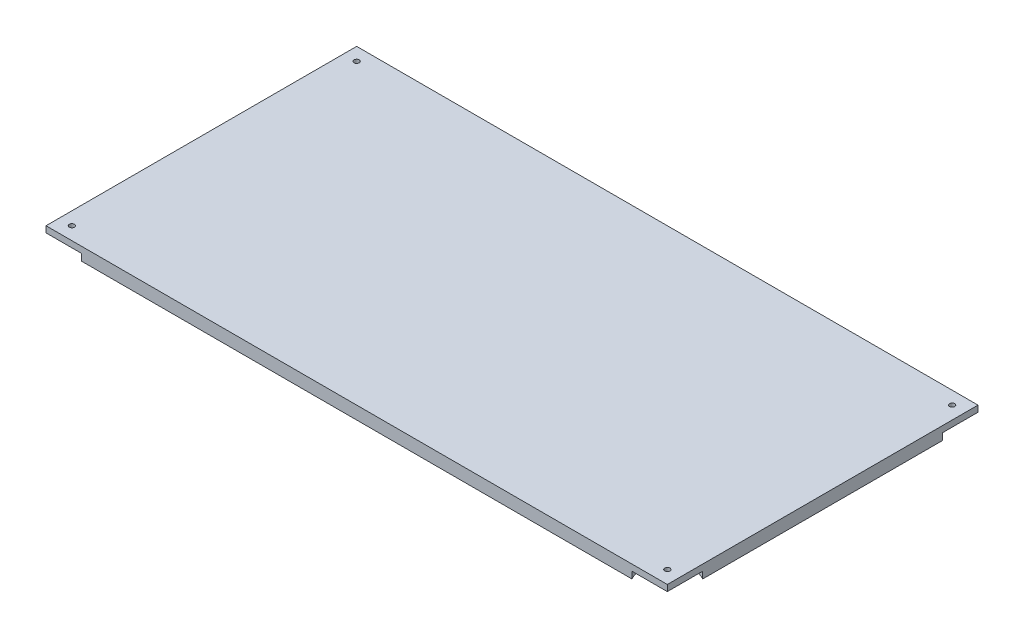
ISO-10303-21;
HEADER;
FILE_DESCRIPTION(('STEP AP214'),'2;1');
FILE_NAME('part.step','',(''),(''),'','','');
FILE_SCHEMA(('AUTOMOTIVE_DESIGN { 1 0 10303 214 1 1 1 1 }'));
ENDSEC;
DATA;
#1=APPLICATION_CONTEXT('core data for automotive mechanical design processes');
#2=APPLICATION_PROTOCOL_DEFINITION('international standard','automotive_design',2000,#1);
#3=PRODUCT_CONTEXT('',#1,'mechanical');
#4=PRODUCT('Part','Part','',(#3));
#5=PRODUCT_RELATED_PRODUCT_CATEGORY('part','',(#4));
#6=PRODUCT_DEFINITION_FORMATION('','',#4);
#7=PRODUCT_DEFINITION_CONTEXT('part definition',#1,'design');
#8=PRODUCT_DEFINITION('design','',#6,#7);
#9=PRODUCT_DEFINITION_SHAPE('','',#8);
#10=(LENGTH_UNIT() NAMED_UNIT(*) SI_UNIT(.MILLI.,.METRE.));
#11=(NAMED_UNIT(*) PLANE_ANGLE_UNIT() SI_UNIT($,.RADIAN.));
#12=(NAMED_UNIT(*) SI_UNIT($,.STERADIAN.) SOLID_ANGLE_UNIT());
#13=UNCERTAINTY_MEASURE_WITH_UNIT(LENGTH_MEASURE(1.E-05),#10,'distance_accuracy_value','');
#14=(GEOMETRIC_REPRESENTATION_CONTEXT(3) GLOBAL_UNCERTAINTY_ASSIGNED_CONTEXT((#13)) GLOBAL_UNIT_ASSIGNED_CONTEXT((#10,
#11,#12)) REPRESENTATION_CONTEXT('',''));
#15=CARTESIAN_POINT('',(0.,0.,0.));
#16=DIRECTION('',(0.,0.,1.));
#17=DIRECTION('',(1.,0.,0.));
#18=AXIS2_PLACEMENT_3D('',#15,#16,#17);
#19=CARTESIAN_POINT('',(-48.4646519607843,0.,115.611650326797));
#20=DIRECTION('',(0.,1.,0.));
#21=DIRECTION('',(0.,0.,1.));
#22=AXIS2_PLACEMENT_3D('',#19,#20,#21);
#23=PLANE('',#22);
#24=CARTESIAN_POINT('',(249.985348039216,0.,-30.4383496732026));
#25=DIRECTION('',(0.,-1.,0.));
#26=DIRECTION('',(0.,0.,-1.));
#27=AXIS2_PLACEMENT_3D('',#24,#25,#26);
#28=CIRCLE('',#27,12.7);
#29=CARTESIAN_POINT('',(256.335348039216,0.,-19.4398270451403));
#30=VERTEX_POINT('',#29);
#31=CARTESIAN_POINT('',(238.986825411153,0.,-36.7883496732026));
#32=VERTEX_POINT('',#31);
#33=EDGE_CURVE('E45',#30,#32,#28,.T.);
#34=ORIENTED_EDGE('',*,*,#33,.F.);
#35=DIRECTION('',(0.,0.,-1.));
#36=VECTOR('',#35,1.);
#37=CARTESIAN_POINT('',(256.335348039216,0.,-36.7883496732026));
#38=LINE('',#37,#36);
#39=CARTESIAN_POINT('',(256.335348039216,0.,98.263127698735));
#40=VERTEX_POINT('',#39);
#41=EDGE_CURVE('E138',#40,#30,#38,.T.);
#42=ORIENTED_EDGE('',*,*,#41,.F.);
#43=CARTESIAN_POINT('',(249.985348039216,0.,109.261650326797));
#44=DIRECTION('',(0.,1.,0.));
#45=DIRECTION('',(0.,0.,1.));
#46=AXIS2_PLACEMENT_3D('',#43,#44,#45);
#47=CIRCLE('',#46,12.7);
#48=CARTESIAN_POINT('',(238.986825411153,0.,115.611650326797));
#49=VERTEX_POINT('',#48);
#50=EDGE_CURVE('E225',#40,#49,#47,.T.);
#51=ORIENTED_EDGE('',*,*,#50,.T.);
#52=DIRECTION('',(1.,0.,0.));
#53=VECTOR('',#52,1.);
#54=CARTESIAN_POINT('',(-48.4646519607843,0.,115.611650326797));
#55=LINE('',#54,#53);
#56=CARTESIAN_POINT('',(-31.1161293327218,0.,115.611650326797));
#57=VERTEX_POINT('',#56);
#58=EDGE_CURVE('E211',#57,#49,#55,.T.);
#59=ORIENTED_EDGE('',*,*,#58,.F.);
#60=CARTESIAN_POINT('',(-42.1146519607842,0.,109.261650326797));
#61=DIRECTION('',(0.,-1.,0.));
#62=DIRECTION('',(0.,0.,-1.));
#63=AXIS2_PLACEMENT_3D('',#60,#61,#62);
#64=CIRCLE('',#63,12.7);
#65=CARTESIAN_POINT('',(-48.4646519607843,0.,98.2631276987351));
#66=VERTEX_POINT('',#65);
#67=EDGE_CURVE('E163',#66,#57,#64,.T.);
#68=ORIENTED_EDGE('',*,*,#67,.F.);
#69=DIRECTION('',(0.,0.,1.));
#70=VECTOR('',#69,1.);
#71=CARTESIAN_POINT('',(-48.4646519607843,0.,-36.7883496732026));
#72=LINE('',#71,#70);
#73=CARTESIAN_POINT('',(-48.4646519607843,0.,-19.4398270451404));
#74=VERTEX_POINT('',#73);
#75=EDGE_CURVE('E199',#74,#66,#72,.T.);
#76=ORIENTED_EDGE('',*,*,#75,.F.);
#77=CARTESIAN_POINT('',(-42.1146519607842,0.,-30.4383496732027));
#78=DIRECTION('',(0.,-1.,0.));
#79=DIRECTION('',(0.,0.,-1.));
#80=AXIS2_PLACEMENT_3D('',#77,#78,#79);
#81=CIRCLE('',#80,12.7);
#82=CARTESIAN_POINT('',(-31.1161293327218,0.,-36.7883496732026));
#83=VERTEX_POINT('',#82);
#84=EDGE_CURVE('E142',#83,#74,#81,.T.);
#85=ORIENTED_EDGE('',*,*,#84,.F.);
#86=DIRECTION('',(-1.,0.,0.));
#87=VECTOR('',#86,1.);
#88=CARTESIAN_POINT('',(-48.4646519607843,0.,-36.7883496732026));
#89=LINE('',#88,#87);
#90=EDGE_CURVE('E51',#32,#83,#89,.T.);
#91=ORIENTED_EDGE('',*,*,#90,.F.);
#92=EDGE_LOOP('',(#34,#42,#51,#59,#68,#76,#85,#91));
#93=FACE_BOUND('',#92,.T.);
#94=ADVANCED_FACE('F30',(#93),#23,.F.);
#95=CARTESIAN_POINT('',(-48.4646519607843,6.35,-36.7883496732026));
#96=DIRECTION('',(1.,0.,0.));
#97=DIRECTION('',(0.,0.,-1.));
#98=AXIS2_PLACEMENT_3D('',#95,#96,#97);
#99=PLANE('',#98);
#100=DIRECTION('',(0.,-1.,0.));
#101=VECTOR('',#100,1.);
#102=CARTESIAN_POINT('',(-48.4646519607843,6.35,-36.7883496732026));
#103=LINE('',#102,#101);
#104=CARTESIAN_POINT('',(-48.4646519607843,6.35,-36.7883496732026));
#105=VERTEX_POINT('',#104);
#106=CARTESIAN_POINT('',(-48.4646519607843,3.302,-36.7883496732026));
#107=VERTEX_POINT('',#106);
#108=EDGE_CURVE('E209',#105,#107,#103,.T.);
#109=ORIENTED_EDGE('',*,*,#108,.T.);
#110=DIRECTION('',(0.,0.,1.));
#111=VECTOR('',#110,1.);
#112=CARTESIAN_POINT('',(-48.4646519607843,3.302,-36.7883496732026));
#113=LINE('',#112,#111);
#114=CARTESIAN_POINT('',(-48.4646519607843,3.302,-19.4398270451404));
#115=VERTEX_POINT('',#114);
#116=EDGE_CURVE('E154',#107,#115,#113,.T.);
#117=ORIENTED_EDGE('',*,*,#116,.T.);
#118=DIRECTION('',(0.,-1.,0.));
#119=VECTOR('',#118,1.);
#120=CARTESIAN_POINT('',(-48.4646519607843,0.,-19.4398270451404));
#121=LINE('',#120,#119);
#122=EDGE_CURVE('E157',#115,#74,#121,.T.);
#123=ORIENTED_EDGE('',*,*,#122,.T.);
#124=ORIENTED_EDGE('',*,*,#75,.T.);
#125=DIRECTION('',(0.,-1.,0.));
#126=VECTOR('',#125,1.);
#127=CARTESIAN_POINT('',(-48.4646519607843,0.,98.2631276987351));
#128=LINE('',#127,#126);
#129=CARTESIAN_POINT('',(-48.4646519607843,3.302,98.2631276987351));
#130=VERTEX_POINT('',#129);
#131=EDGE_CURVE('E175',#66,#130,#128,.F.);
#132=ORIENTED_EDGE('',*,*,#131,.T.);
#133=DIRECTION('',(0.,0.,1.));
#134=VECTOR('',#133,1.);
#135=CARTESIAN_POINT('',(-48.4646519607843,3.302,-36.7883496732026));
#136=LINE('',#135,#134);
#137=CARTESIAN_POINT('',(-48.4646519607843,3.302,115.611650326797));
#138=VERTEX_POINT('',#137);
#139=EDGE_CURVE('E172',#130,#138,#136,.T.);
#140=ORIENTED_EDGE('',*,*,#139,.T.);
#141=DIRECTION('',(0.,-1.,0.));
#142=VECTOR('',#141,1.);
#143=CARTESIAN_POINT('',(-48.4646519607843,6.35,115.611650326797));
#144=LINE('',#143,#142);
#145=CARTESIAN_POINT('',(-48.4646519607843,6.35,115.611650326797));
#146=VERTEX_POINT('',#145);
#147=EDGE_CURVE('E222',#146,#138,#144,.T.);
#148=ORIENTED_EDGE('',*,*,#147,.F.);
#149=DIRECTION('',(0.,0.,1.));
#150=VECTOR('',#149,1.);
#151=CARTESIAN_POINT('',(-48.4646519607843,6.35,-36.7883496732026));
#152=LINE('',#151,#150);
#153=EDGE_CURVE('E200',#105,#146,#152,.T.);
#154=ORIENTED_EDGE('',*,*,#153,.F.);
#155=EDGE_LOOP('',(#109,#117,#123,#124,#132,#140,#148,#154));
#156=FACE_BOUND('',#155,.T.);
#157=ADVANCED_FACE('F32',(#156),#99,.F.);
#158=CARTESIAN_POINT('',(-48.4646519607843,6.35,115.611650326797));
#159=DIRECTION('',(0.,0.,-1.));
#160=DIRECTION('',(-1.,0.,0.));
#161=AXIS2_PLACEMENT_3D('',#158,#159,#160);
#162=PLANE('',#161);
#163=ORIENTED_EDGE('',*,*,#147,.T.);
#164=DIRECTION('',(1.,0.,0.));
#165=VECTOR('',#164,1.);
#166=CARTESIAN_POINT('',(-48.4646519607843,3.302,115.611650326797));
#167=LINE('',#166,#165);
#168=CARTESIAN_POINT('',(-31.1161293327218,3.302,115.611650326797));
#169=VERTEX_POINT('',#168);
#170=EDGE_CURVE('E169',#138,#169,#167,.T.);
#171=ORIENTED_EDGE('',*,*,#170,.T.);
#172=DIRECTION('',(0.,-1.,0.));
#173=VECTOR('',#172,1.);
#174=CARTESIAN_POINT('',(-31.1161293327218,0.,115.611650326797));
#175=LINE('',#174,#173);
#176=EDGE_CURVE('E228',#169,#57,#175,.T.);
#177=ORIENTED_EDGE('',*,*,#176,.T.);
#178=ORIENTED_EDGE('',*,*,#58,.T.);
#179=DIRECTION('',(0.,-1.,0.));
#180=VECTOR('',#179,1.);
#181=CARTESIAN_POINT('',(238.986825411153,0.,115.611650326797));
#182=LINE('',#181,#180);
#183=CARTESIAN_POINT('',(238.986825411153,3.302,115.611650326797));
#184=VERTEX_POINT('',#183);
#185=EDGE_CURVE('E186',#49,#184,#182,.F.);
#186=ORIENTED_EDGE('',*,*,#185,.T.);
#187=DIRECTION('',(1.,0.,0.));
#188=VECTOR('',#187,1.);
#189=CARTESIAN_POINT('',(-48.4646519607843,3.302,115.611650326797));
#190=LINE('',#189,#188);
#191=CARTESIAN_POINT('',(256.335348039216,3.302,115.611650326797));
#192=VERTEX_POINT('',#191);
#193=EDGE_CURVE('E193',#184,#192,#190,.T.);
#194=ORIENTED_EDGE('',*,*,#193,.T.);
#195=DIRECTION('',(0.,-1.,0.));
#196=VECTOR('',#195,1.);
#197=CARTESIAN_POINT('',(256.335348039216,6.35,115.611650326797));
#198=LINE('',#197,#196);
#199=CARTESIAN_POINT('',(256.335348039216,6.35,115.611650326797));
#200=VERTEX_POINT('',#199);
#201=EDGE_CURVE('E219',#200,#192,#198,.T.);
#202=ORIENTED_EDGE('',*,*,#201,.F.);
#203=DIRECTION('',(1.,0.,0.));
#204=VECTOR('',#203,1.);
#205=CARTESIAN_POINT('',(-48.4646519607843,6.35,115.611650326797));
#206=LINE('',#205,#204);
#207=EDGE_CURVE('E203',#146,#200,#206,.T.);
#208=ORIENTED_EDGE('',*,*,#207,.F.);
#209=EDGE_LOOP('',(#163,#171,#177,#178,#186,#194,#202,#208));
#210=FACE_BOUND('',#209,.T.);
#211=ADVANCED_FACE('F251',(#210),#162,.F.);
#212=CARTESIAN_POINT('',(256.335348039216,6.35,-36.7883496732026));
#213=DIRECTION('',(-1.,0.,0.));
#214=DIRECTION('',(0.,0.,1.));
#215=AXIS2_PLACEMENT_3D('',#212,#213,#214);
#216=PLANE('',#215);
#217=DIRECTION('',(0.,-1.,0.));
#218=VECTOR('',#217,1.);
#219=CARTESIAN_POINT('',(256.335348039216,0.,-19.4398270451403));
#220=LINE('',#219,#218);
#221=CARTESIAN_POINT('',(256.335348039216,3.302,-19.4398270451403));
#222=VERTEX_POINT('',#221);
#223=EDGE_CURVE('E129',#30,#222,#220,.F.);
#224=ORIENTED_EDGE('',*,*,#223,.T.);
#225=DIRECTION('',(0.,0.,-1.));
#226=VECTOR('',#225,1.);
#227=CARTESIAN_POINT('',(256.335348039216,3.302,-36.7883496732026));
#228=LINE('',#227,#226);
#229=CARTESIAN_POINT('',(256.335348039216,3.302,-36.7883496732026));
#230=VERTEX_POINT('',#229);
#231=EDGE_CURVE('E119',#222,#230,#228,.T.);
#232=ORIENTED_EDGE('',*,*,#231,.T.);
#233=DIRECTION('',(0.,-1.,0.));
#234=VECTOR('',#233,1.);
#235=CARTESIAN_POINT('',(256.335348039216,6.35,-36.7883496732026));
#236=LINE('',#235,#234);
#237=CARTESIAN_POINT('',(256.335348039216,6.35,-36.7883496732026));
#238=VERTEX_POINT('',#237);
#239=EDGE_CURVE('E217',#238,#230,#236,.T.);
#240=ORIENTED_EDGE('',*,*,#239,.F.);
#241=DIRECTION('',(0.,0.,-1.));
#242=VECTOR('',#241,1.);
#243=CARTESIAN_POINT('',(256.335348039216,6.35,-36.7883496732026));
#244=LINE('',#243,#242);
#245=EDGE_CURVE('E205',#200,#238,#244,.T.);
#246=ORIENTED_EDGE('',*,*,#245,.F.);
#247=ORIENTED_EDGE('',*,*,#201,.T.);
#248=DIRECTION('',(0.,0.,-1.));
#249=VECTOR('',#248,1.);
#250=CARTESIAN_POINT('',(256.335348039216,3.302,-36.7883496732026));
#251=LINE('',#250,#249);
#252=CARTESIAN_POINT('',(256.335348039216,3.302,98.263127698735));
#253=VERTEX_POINT('',#252);
#254=EDGE_CURVE('E190',#192,#253,#251,.T.);
#255=ORIENTED_EDGE('',*,*,#254,.T.);
#256=DIRECTION('',(0.,-1.,0.));
#257=VECTOR('',#256,1.);
#258=CARTESIAN_POINT('',(256.335348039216,0.,98.263127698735));
#259=LINE('',#258,#257);
#260=EDGE_CURVE('E184',#253,#40,#259,.T.);
#261=ORIENTED_EDGE('',*,*,#260,.T.);
#262=ORIENTED_EDGE('',*,*,#41,.T.);
#263=EDGE_LOOP('',(#224,#232,#240,#246,#247,#255,#261,#262));
#264=FACE_BOUND('',#263,.T.);
#265=ADVANCED_FACE('F135',(#264),#216,.F.);
#266=CARTESIAN_POINT('',(-48.4646519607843,6.35,-36.7883496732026));
#267=DIRECTION('',(0.,0.,1.));
#268=DIRECTION('',(1.,0.,0.));
#269=AXIS2_PLACEMENT_3D('',#266,#267,#268);
#270=PLANE('',#269);
#271=ORIENTED_EDGE('',*,*,#239,.T.);
#272=DIRECTION('',(-1.,0.,0.));
#273=VECTOR('',#272,1.);
#274=CARTESIAN_POINT('',(-48.4646519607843,3.302,-36.7883496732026));
#275=LINE('',#274,#273);
#276=CARTESIAN_POINT('',(238.986825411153,3.302,-36.7883496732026));
#277=VERTEX_POINT('',#276);
#278=EDGE_CURVE('E124',#230,#277,#275,.T.);
#279=ORIENTED_EDGE('',*,*,#278,.T.);
#280=DIRECTION('',(0.,-1.,0.));
#281=VECTOR('',#280,1.);
#282=CARTESIAN_POINT('',(238.986825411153,0.,-36.7883496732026));
#283=LINE('',#282,#281);
#284=EDGE_CURVE('E11',#277,#32,#283,.T.);
#285=ORIENTED_EDGE('',*,*,#284,.T.);
#286=ORIENTED_EDGE('',*,*,#90,.T.);
#287=DIRECTION('',(0.,-1.,0.));
#288=VECTOR('',#287,1.);
#289=CARTESIAN_POINT('',(-31.1161293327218,0.,-36.7883496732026));
#290=LINE('',#289,#288);
#291=CARTESIAN_POINT('',(-31.1161293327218,3.302,-36.7883496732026));
#292=VERTEX_POINT('',#291);
#293=EDGE_CURVE('E38',#83,#292,#290,.F.);
#294=ORIENTED_EDGE('',*,*,#293,.T.);
#295=DIRECTION('',(-1.,0.,0.));
#296=VECTOR('',#295,1.);
#297=CARTESIAN_POINT('',(-48.4646519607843,3.302,-36.7883496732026));
#298=LINE('',#297,#296);
#299=EDGE_CURVE('E151',#292,#107,#298,.T.);
#300=ORIENTED_EDGE('',*,*,#299,.T.);
#301=ORIENTED_EDGE('',*,*,#108,.F.);
#302=DIRECTION('',(-1.,0.,0.));
#303=VECTOR('',#302,1.);
#304=CARTESIAN_POINT('',(-48.4646519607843,6.35,-36.7883496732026));
#305=LINE('',#304,#303);
#306=EDGE_CURVE('E207',#238,#105,#305,.T.);
#307=ORIENTED_EDGE('',*,*,#306,.F.);
#308=EDGE_LOOP('',(#271,#279,#285,#286,#294,#300,#301,#307));
#309=FACE_BOUND('',#308,.T.);
#310=ADVANCED_FACE('F241',(#309),#270,.F.);
#311=CARTESIAN_POINT('',(-48.4646519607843,6.35,115.611650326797));
#312=DIRECTION('',(0.,1.,0.));
#313=DIRECTION('',(0.,0.,1.));
#314=AXIS2_PLACEMENT_3D('',#311,#312,#313);
#315=PLANE('',#314);
#316=CARTESIAN_POINT('',(249.985348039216,6.35,-30.4383496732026));
#317=DIRECTION('',(0.,1.,0.));
#318=DIRECTION('',(0.,0.,1.));
#319=AXIS2_PLACEMENT_3D('',#316,#317,#318);
#320=CIRCLE('',#319,1.26999999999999);
#321=CARTESIAN_POINT('',(249.985348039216,6.35,-29.1683496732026));
#322=VERTEX_POINT('',#321);
#323=EDGE_CURVE('E139',#322,#322,#320,.T.);
#324=ORIENTED_EDGE('',*,*,#323,.F.);
#325=EDGE_LOOP('',(#324));
#326=FACE_BOUND('',#325,.T.);
#327=CARTESIAN_POINT('',(-42.1146519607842,6.35,-30.4383496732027));
#328=DIRECTION('',(0.,1.,0.));
#329=DIRECTION('',(0.,0.,1.));
#330=AXIS2_PLACEMENT_3D('',#327,#328,#329);
#331=CIRCLE('',#330,1.26999999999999);
#332=CARTESIAN_POINT('',(-42.1146519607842,6.35,-29.1683496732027));
#333=VERTEX_POINT('',#332);
#334=EDGE_CURVE('E160',#333,#333,#331,.T.);
#335=ORIENTED_EDGE('',*,*,#334,.F.);
#336=EDGE_LOOP('',(#335));
#337=FACE_BOUND('',#336,.T.);
#338=CARTESIAN_POINT('',(-42.1146519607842,6.35,109.261650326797));
#339=DIRECTION('',(0.,1.,0.));
#340=DIRECTION('',(0.,0.,1.));
#341=AXIS2_PLACEMENT_3D('',#338,#339,#340);
#342=CIRCLE('',#341,1.26999999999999);
#343=CARTESIAN_POINT('',(-42.1146519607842,6.35,110.531650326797));
#344=VERTEX_POINT('',#343);
#345=EDGE_CURVE('E178',#344,#344,#342,.T.);
#346=ORIENTED_EDGE('',*,*,#345,.F.);
#347=EDGE_LOOP('',(#346));
#348=FACE_BOUND('',#347,.T.);
#349=CARTESIAN_POINT('',(249.985348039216,6.35,109.261650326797));
#350=DIRECTION('',(0.,1.,0.));
#351=DIRECTION('',(0.,0.,1.));
#352=AXIS2_PLACEMENT_3D('',#349,#350,#351);
#353=CIRCLE('',#352,1.26999999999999);
#354=CARTESIAN_POINT('',(249.985348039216,6.35,110.531650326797));
#355=VERTEX_POINT('',#354);
#356=EDGE_CURVE('E196',#355,#355,#353,.T.);
#357=ORIENTED_EDGE('',*,*,#356,.F.);
#358=EDGE_LOOP('',(#357));
#359=FACE_BOUND('',#358,.T.);
#360=ORIENTED_EDGE('',*,*,#153,.T.);
#361=ORIENTED_EDGE('',*,*,#207,.T.);
#362=ORIENTED_EDGE('',*,*,#245,.T.);
#363=ORIENTED_EDGE('',*,*,#306,.T.);
#364=EDGE_LOOP('',(#360,#361,#362,#363));
#365=FACE_BOUND('',#364,.T.);
#366=ADVANCED_FACE('F247',(#326,#337,#348,#359,#365),#315,.T.);
#367=CARTESIAN_POINT('',(249.985348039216,0.,109.261650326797));
#368=DIRECTION('',(0.,-1.,0.));
#369=DIRECTION('',(0.,0.,-1.));
#370=AXIS2_PLACEMENT_3D('',#367,#368,#369);
#371=CYLINDRICAL_SURFACE('',#370,1.26999999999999);
#372=CARTESIAN_POINT('',(249.985348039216,3.302,109.261650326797));
#373=DIRECTION('',(0.,1.,0.));
#374=DIRECTION('',(0.,0.,1.));
#375=AXIS2_PLACEMENT_3D('',#372,#373,#374);
#376=CIRCLE('',#375,1.26999999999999);
#377=CARTESIAN_POINT('',(249.985348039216,3.302,110.531650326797));
#378=VERTEX_POINT('',#377);
#379=EDGE_CURVE('E189',#378,#378,#376,.F.);
#380=ORIENTED_EDGE('',*,*,#379,.T.);
#381=EDGE_LOOP('',(#380));
#382=FACE_BOUND('',#381,.T.);
#383=ORIENTED_EDGE('',*,*,#356,.T.);
#384=EDGE_LOOP('',(#383));
#385=FACE_BOUND('',#384,.T.);
#386=ADVANCED_FACE('F320',(#382,#385),#371,.F.);
#387=CARTESIAN_POINT('',(249.985348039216,3.302,109.261650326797));
#388=DIRECTION('',(0.,1.,0.));
#389=DIRECTION('',(0.,0.,1.));
#390=AXIS2_PLACEMENT_3D('',#387,#388,#389);
#391=PLANE('',#390);
#392=ORIENTED_EDGE('',*,*,#379,.F.);
#393=EDGE_LOOP('',(#392));
#394=FACE_BOUND('',#393,.T.);
#395=CARTESIAN_POINT('',(249.985348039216,3.302,109.261650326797));
#396=DIRECTION('',(0.,-1.,0.));
#397=DIRECTION('',(0.,0.,-1.));
#398=AXIS2_PLACEMENT_3D('',#395,#396,#397);
#399=CIRCLE('',#398,12.7);
#400=EDGE_CURVE('E181',#184,#253,#399,.T.);
#401=ORIENTED_EDGE('',*,*,#400,.T.);
#402=ORIENTED_EDGE('',*,*,#254,.F.);
#403=ORIENTED_EDGE('',*,*,#193,.F.);
#404=EDGE_LOOP('',(#401,#402,#403));
#405=FACE_BOUND('',#404,.T.);
#406=ADVANCED_FACE('F255',(#394,#405),#391,.F.);
#407=CARTESIAN_POINT('',(249.985348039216,0.,109.261650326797));
#408=DIRECTION('',(0.,-1.,0.));
#409=DIRECTION('',(0.,0.,-1.));
#410=AXIS2_PLACEMENT_3D('',#407,#408,#409);
#411=CYLINDRICAL_SURFACE('',#410,12.7);
#412=ORIENTED_EDGE('',*,*,#50,.F.);
#413=ORIENTED_EDGE('',*,*,#260,.F.);
#414=ORIENTED_EDGE('',*,*,#400,.F.);
#415=ORIENTED_EDGE('',*,*,#185,.F.);
#416=EDGE_LOOP('',(#412,#413,#414,#415));
#417=FACE_BOUND('',#416,.T.);
#418=ADVANCED_FACE('F257',(#417),#411,.F.);
#419=CARTESIAN_POINT('',(-42.1146519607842,0.,109.261650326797));
#420=DIRECTION('',(0.,-1.,0.));
#421=DIRECTION('',(0.,0.,-1.));
#422=AXIS2_PLACEMENT_3D('',#419,#420,#421);
#423=CYLINDRICAL_SURFACE('',#422,1.26999999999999);
#424=CARTESIAN_POINT('',(-42.1146519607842,3.302,109.261650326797));
#425=DIRECTION('',(0.,1.,0.));
#426=DIRECTION('',(0.,0.,1.));
#427=AXIS2_PLACEMENT_3D('',#424,#425,#426);
#428=CIRCLE('',#427,1.26999999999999);
#429=CARTESIAN_POINT('',(-42.1146519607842,3.302,110.531650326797));
#430=VERTEX_POINT('',#429);
#431=EDGE_CURVE('E168',#430,#430,#428,.F.);
#432=ORIENTED_EDGE('',*,*,#431,.T.);
#433=EDGE_LOOP('',(#432));
#434=FACE_BOUND('',#433,.T.);
#435=ORIENTED_EDGE('',*,*,#345,.T.);
#436=EDGE_LOOP('',(#435));
#437=FACE_BOUND('',#436,.T.);
#438=ADVANCED_FACE('F276',(#434,#437),#423,.F.);
#439=CARTESIAN_POINT('',(-42.1146519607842,0.,109.261650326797));
#440=DIRECTION('',(0.,-1.,0.));
#441=DIRECTION('',(0.,0.,-1.));
#442=AXIS2_PLACEMENT_3D('',#439,#440,#441);
#443=CYLINDRICAL_SURFACE('',#442,12.7);
#444=ORIENTED_EDGE('',*,*,#67,.T.);
#445=ORIENTED_EDGE('',*,*,#176,.F.);
#446=CARTESIAN_POINT('',(-42.1146519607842,3.302,109.261650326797));
#447=DIRECTION('',(0.,-1.,0.));
#448=DIRECTION('',(0.,0.,-1.));
#449=AXIS2_PLACEMENT_3D('',#446,#447,#448);
#450=CIRCLE('',#449,12.7);
#451=EDGE_CURVE('E165',#130,#169,#450,.T.);
#452=ORIENTED_EDGE('',*,*,#451,.F.);
#453=ORIENTED_EDGE('',*,*,#131,.F.);
#454=EDGE_LOOP('',(#444,#445,#452,#453));
#455=FACE_BOUND('',#454,.T.);
#456=ADVANCED_FACE('F274',(#455),#443,.F.);
#457=CARTESIAN_POINT('',(-42.1146519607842,3.302,109.261650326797));
#458=DIRECTION('',(0.,1.,0.));
#459=DIRECTION('',(0.,0.,1.));
#460=AXIS2_PLACEMENT_3D('',#457,#458,#459);
#461=PLANE('',#460);
#462=ORIENTED_EDGE('',*,*,#431,.F.);
#463=EDGE_LOOP('',(#462));
#464=FACE_BOUND('',#463,.T.);
#465=ORIENTED_EDGE('',*,*,#451,.T.);
#466=ORIENTED_EDGE('',*,*,#170,.F.);
#467=ORIENTED_EDGE('',*,*,#139,.F.);
#468=EDGE_LOOP('',(#465,#466,#467));
#469=FACE_BOUND('',#468,.T.);
#470=ADVANCED_FACE('F271',(#464,#469),#461,.F.);
#471=CARTESIAN_POINT('',(-42.1146519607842,0.,-30.4383496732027));
#472=DIRECTION('',(0.,-1.,0.));
#473=DIRECTION('',(0.,0.,-1.));
#474=AXIS2_PLACEMENT_3D('',#471,#472,#473);
#475=CYLINDRICAL_SURFACE('',#474,1.26999999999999);
#476=CARTESIAN_POINT('',(-42.1146519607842,3.302,-30.4383496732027));
#477=DIRECTION('',(0.,1.,0.));
#478=DIRECTION('',(0.,0.,1.));
#479=AXIS2_PLACEMENT_3D('',#476,#477,#478);
#480=CIRCLE('',#479,1.26999999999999);
#481=CARTESIAN_POINT('',(-42.1146519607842,3.302,-29.1683496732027));
#482=VERTEX_POINT('',#481);
#483=EDGE_CURVE('E150',#482,#482,#480,.F.);
#484=ORIENTED_EDGE('',*,*,#483,.T.);
#485=EDGE_LOOP('',(#484));
#486=FACE_BOUND('',#485,.T.);
#487=ORIENTED_EDGE('',*,*,#334,.T.);
#488=EDGE_LOOP('',(#487));
#489=FACE_BOUND('',#488,.T.);
#490=ADVANCED_FACE('F282',(#486,#489),#475,.F.);
#491=CARTESIAN_POINT('',(-42.1146519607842,0.,-30.4383496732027));
#492=DIRECTION('',(0.,-1.,0.));
#493=DIRECTION('',(0.,0.,-1.));
#494=AXIS2_PLACEMENT_3D('',#491,#492,#493);
#495=CYLINDRICAL_SURFACE('',#494,12.7);
#496=CARTESIAN_POINT('',(-42.1146519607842,3.302,-30.4383496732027));
#497=DIRECTION('',(0.,-1.,0.));
#498=DIRECTION('',(0.,0.,-1.));
#499=AXIS2_PLACEMENT_3D('',#496,#497,#498);
#500=CIRCLE('',#499,12.7);
#501=EDGE_CURVE('E147',#292,#115,#500,.T.);
#502=ORIENTED_EDGE('',*,*,#501,.F.);
#503=ORIENTED_EDGE('',*,*,#293,.F.);
#504=ORIENTED_EDGE('',*,*,#84,.T.);
#505=ORIENTED_EDGE('',*,*,#122,.F.);
#506=EDGE_LOOP('',(#502,#503,#504,#505));
#507=FACE_BOUND('',#506,.T.);
#508=ADVANCED_FACE('F265',(#507),#495,.F.);
#509=CARTESIAN_POINT('',(-42.1146519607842,3.302,-30.4383496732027));
#510=DIRECTION('',(0.,1.,0.));
#511=DIRECTION('',(0.,0.,1.));
#512=AXIS2_PLACEMENT_3D('',#509,#510,#511);
#513=PLANE('',#512);
#514=ORIENTED_EDGE('',*,*,#483,.F.);
#515=EDGE_LOOP('',(#514));
#516=FACE_BOUND('',#515,.T.);
#517=ORIENTED_EDGE('',*,*,#299,.F.);
#518=ORIENTED_EDGE('',*,*,#501,.T.);
#519=ORIENTED_EDGE('',*,*,#116,.F.);
#520=EDGE_LOOP('',(#517,#518,#519));
#521=FACE_BOUND('',#520,.T.);
#522=ADVANCED_FACE('F269',(#516,#521),#513,.F.);
#523=CARTESIAN_POINT('',(249.985348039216,0.,-30.4383496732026));
#524=DIRECTION('',(0.,-1.,0.));
#525=DIRECTION('',(0.,0.,-1.));
#526=AXIS2_PLACEMENT_3D('',#523,#524,#525);
#527=CYLINDRICAL_SURFACE('',#526,1.26999999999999);
#528=CARTESIAN_POINT('',(249.985348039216,3.302,-30.4383496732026));
#529=DIRECTION('',(0.,1.,0.));
#530=DIRECTION('',(0.,0.,1.));
#531=AXIS2_PLACEMENT_3D('',#528,#529,#530);
#532=CIRCLE('',#531,1.26999999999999);
#533=CARTESIAN_POINT('',(249.985348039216,3.302,-29.1683496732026));
#534=VERTEX_POINT('',#533);
#535=EDGE_CURVE('E132',#534,#534,#532,.F.);
#536=ORIENTED_EDGE('',*,*,#535,.T.);
#537=EDGE_LOOP('',(#536));
#538=FACE_BOUND('',#537,.T.);
#539=ORIENTED_EDGE('',*,*,#323,.T.);
#540=EDGE_LOOP('',(#539));
#541=FACE_BOUND('',#540,.T.);
#542=ADVANCED_FACE('F383',(#538,#541),#527,.F.);
#543=CARTESIAN_POINT('',(249.985348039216,0.,-30.4383496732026));
#544=DIRECTION('',(0.,-1.,0.));
#545=DIRECTION('',(0.,0.,-1.));
#546=AXIS2_PLACEMENT_3D('',#543,#544,#545);
#547=CYLINDRICAL_SURFACE('',#546,12.7);
#548=ORIENTED_EDGE('',*,*,#33,.T.);
#549=ORIENTED_EDGE('',*,*,#284,.F.);
#550=CARTESIAN_POINT('',(249.985348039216,3.302,-30.4383496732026));
#551=DIRECTION('',(0.,-1.,0.));
#552=DIRECTION('',(0.,0.,-1.));
#553=AXIS2_PLACEMENT_3D('',#550,#551,#552);
#554=CIRCLE('',#553,12.7);
#555=EDGE_CURVE('E122',#222,#277,#554,.T.);
#556=ORIENTED_EDGE('',*,*,#555,.F.);
#557=ORIENTED_EDGE('',*,*,#223,.F.);
#558=EDGE_LOOP('',(#548,#549,#556,#557));
#559=FACE_BOUND('',#558,.T.);
#560=ADVANCED_FACE('F131',(#559),#547,.F.);
#561=CARTESIAN_POINT('',(249.985348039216,3.302,-30.4383496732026));
#562=DIRECTION('',(0.,1.,0.));
#563=DIRECTION('',(0.,0.,1.));
#564=AXIS2_PLACEMENT_3D('',#561,#562,#563);
#565=PLANE('',#564);
#566=ORIENTED_EDGE('',*,*,#535,.F.);
#567=EDGE_LOOP('',(#566));
#568=FACE_BOUND('',#567,.T.);
#569=ORIENTED_EDGE('',*,*,#555,.T.);
#570=ORIENTED_EDGE('',*,*,#278,.F.);
#571=ORIENTED_EDGE('',*,*,#231,.F.);
#572=EDGE_LOOP('',(#569,#570,#571));
#573=FACE_BOUND('',#572,.T.);
#574=ADVANCED_FACE('F121',(#568,#573),#565,.F.);
#575=CLOSED_SHELL('',(#94,#157,#211,#265,#310,#366,#386,#406,#418,#438,#456,#470,#490,#508,#522,
#542,#560,#574));
#576=MANIFOLD_SOLID_BREP('B2',#575);
#577=ADVANCED_BREP_SHAPE_REPRESENTATION('',(#18,#576),#14);
#578=SHAPE_DEFINITION_REPRESENTATION(#9,#577);
ENDSEC;
END-ISO-10303-21;
